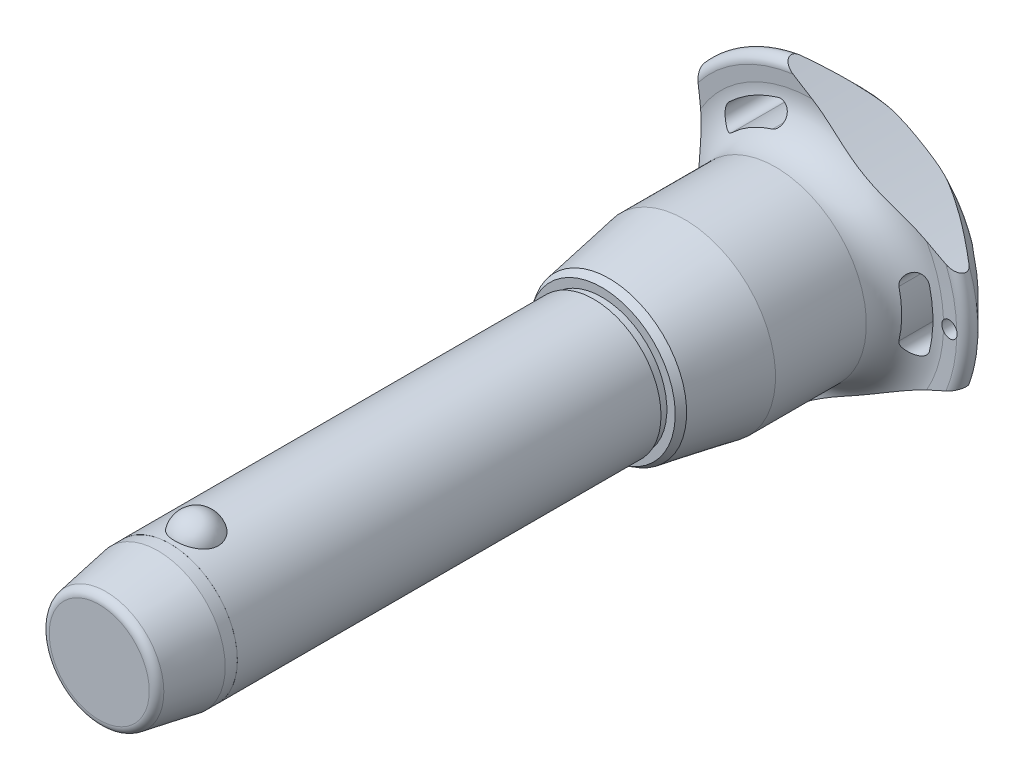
from build123d import *

# Parameters (mm, degrees)
SKETCH1_R           = 12.5
BOSS_EXTRUDE1_DEPTH = 70
SKETCH2_R           = 10
BOSS_EXTRUDE2_DEPTH = 50.7
BOSS_EXTRUDE3_START = 22
SKETCH1_2_R         = 12.5
BOSS_EXTRUDE3_DEPTH = 22
CHAMFER1_SIZE       = 11
CHAMFER1_SIZE2      = 1.939596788
FILLET1_R           = 1.5
SKETCH6_R           = 176.92625
CUT_EXTRUDE1_DEPTH  = 128.274554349
CIRPATTERN1_COUNT   = 3
SKETCH7_R           = 1.5
CUT_EXTRUDE2_DEPTH  = 128.154892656
SKETCH8_R           = 12.5
SKETCH8_R_2         = 12.49
CUT_EXTRUDE3_DEPTH  = 13.2


with BuildPart() as part:
    # Sketch1 → Boss-Extrude1 (new body)
    with BuildSketch(Plane.XY):
        Circle(SKETCH1_R)
    extrude(amount=-BOSS_EXTRUDE1_DEPTH)

    # Sketch2 → Boss-Extrude2 (add)
    with BuildSketch(Plane(origin=(0, 0, -70), x_dir=(-1, 0, 0), z_dir=(0, 0, -1))):
        with Locations(Location((0, 0, 0), (0, 0, 180))):
            Circle(SKETCH2_R)
    extrude(amount=BOSS_EXTRUDE2_DEPTH)

    # Sketch3 → Revolve1 (revolve)
    with BuildSketch(Plane(origin=(0, 0, 0), x_dir=(0, 0, -1), z_dir=(1, 0, 0))):
        with BuildLine():
            Line((-3.957271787, 15.4), (-3.957271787, 7.1))
            ThreePointArc((-3.957271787, 7.1), (0.192728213, 11.25), (-3.957271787, 15.4))
        make_face()
        with BuildLine():
            Line((-3.957271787, -7.1), (-3.957271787, -15.4))
            ThreePointArc((-3.957271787, -15.4), (0.192728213, -11.25), (-3.957271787, -7.1))
        make_face()
    revolve(axis=Axis((0, -7.1, 3.957271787), (0, 1, 0)))

    # Sketch1_2 → Boss-Extrude3 (add)
    with BuildSketch(Plane.XY.offset(BOSS_EXTRUDE3_START)):
        Circle(SKETCH1_2_R)
    extrude(amount=-BOSS_EXTRUDE3_DEPTH)

    # Chamfer1
    chamfer1_edges = [part.edges().sort_by_distance(p)[0] for p in [
        (-12.5, 0, 22),
    ]]
    chamfer1_side = [part.faces().sort_by_distance(p)[0] for p in [
        (-12.5, 0, -24),
    ]]
    chamfer(chamfer1_edges, length=CHAMFER1_SIZE, length2=CHAMFER1_SIZE2, reference=chamfer1_side[0])

    # Fillet1
    fillet1_edges = [part.edges().sort_by_distance(p)[0] for p in [
        (-10.560403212, 0, 22),
        (-10, 0, -120.7),
    ]]
    fillet(fillet1_edges, radius=FILLET1_R)

    # Sketch4 → Revolve2 (revolve)
    with BuildSketch(Plane(origin=(0, 0, 0), x_dir=(0, 0, -1), z_dir=(1, 0, 0)), mode=Mode.PRIVATE) as revolve2_sk:
        Polygon((70, 0), (70, 12.089202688), (71.5, 12.089202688), (71.5, 13.644437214), (72.846872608, 14.422054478), (86.9, 16.9), (103.8, 16.9), (103.8, 0), align=None)
    revolve(revolve2_sk.sketch.rotate(Axis((0, 0, -103.8), (0, 0, 1)), 90), axis=Axis((0, 0, -103.8), (0, 0, 1)))

    # Sketch5 → Revolve3 (revolve)
    with BuildSketch(Plane(origin=(0, 0, 0), x_dir=(0, 0, -1), z_dir=(1, 0, 0)), mode=Mode.PRIVATE) as revolve3_sk:
        with BuildLine():
            Line((110.790129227, 24.271609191), (110.652256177, 26.865060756))
            ThreePointArc((110.652256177, 26.865060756), (111.598671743, 28.411427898), (113.38137085, 28.08137085))
            Line((113.38137085, 28.08137085), (119.763226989, 21.69951471))
            ThreePointArc((119.763226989, 21.69951471), (120.7, 19.381044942), (119.683055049, 17.096604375))
            ThreePointArc((119.683055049, 17.096604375), (114.18864484, 9.321268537), (112.25, 0))
            Line((112.25, 0), (103.8, 0))
            Line((103.8, 0), (103.8, 16.9))
            ThreePointArc((103.8, 16.9), (108.879432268, 19.083427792), (110.790129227, 24.271609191))
        make_face()
    revolve(revolve3_sk.sketch.rotate(Axis((0, 0, -112.25), (0, 0, 1)), 90), axis=Axis((0, 0, -112.25), (0, 0, 1)))

    # Sketch6 → Cut-Extrude1 (cut, through all)
    with BuildSketch(Plane.XY):
        with Locations((-197.42625, 0)):
            Circle(SKETCH6_R)
        with BuildLine():
            ThreePointArc((21.802992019, -5.260839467), (22.428706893, 0), (21.802992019, 5.260839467))
            ThreePointArc((21.802992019, 5.260839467), (19.579234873, 6.620060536), (18.220013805, 4.39630339))
            ThreePointArc((18.220013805, 4.39630339), (18.742902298, 0), (18.220013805, -4.39630339))
            ThreePointArc((18.220013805, -4.39630339), (19.579234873, -6.620060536), (21.802992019, -5.260839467))
        make_face()
    cut_extrude1 = extrude(amount=-CUT_EXTRUDE1_DEPTH, mode=Mode.SUBTRACT)

    # CirPattern1: Cut-Extrude1 ×3 about axis
    cirpattern1_axis = Axis((0, 0, 0), (0, 0, 1))
    for i in range(1, CIRPATTERN1_COUNT):
        add(cut_extrude1.rotate(cirpattern1_axis, i * 360 / CIRPATTERN1_COUNT), mode=Mode.SUBTRACT)

    # Sketch7 → Cut-Extrude2 (cut, through all)
    with BuildSketch(Plane.XY):
        with Locations(Location((25.428706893, 0, 0), (0, 0, 17.230769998))):
            Circle(SKETCH7_R)
    extrude(amount=-CUT_EXTRUDE2_DEPTH, mode=Mode.SUBTRACT)

    # Sketch8 → Cut-Extrude3 (cut)
    with BuildSketch(Plane.XY.offset(22)):
        Circle(SKETCH8_R)
        Circle(SKETCH8_R_2, mode=Mode.SUBTRACT)
    extrude(amount=-CUT_EXTRUDE3_DEPTH, mode=Mode.SUBTRACT)


solid = part.part
